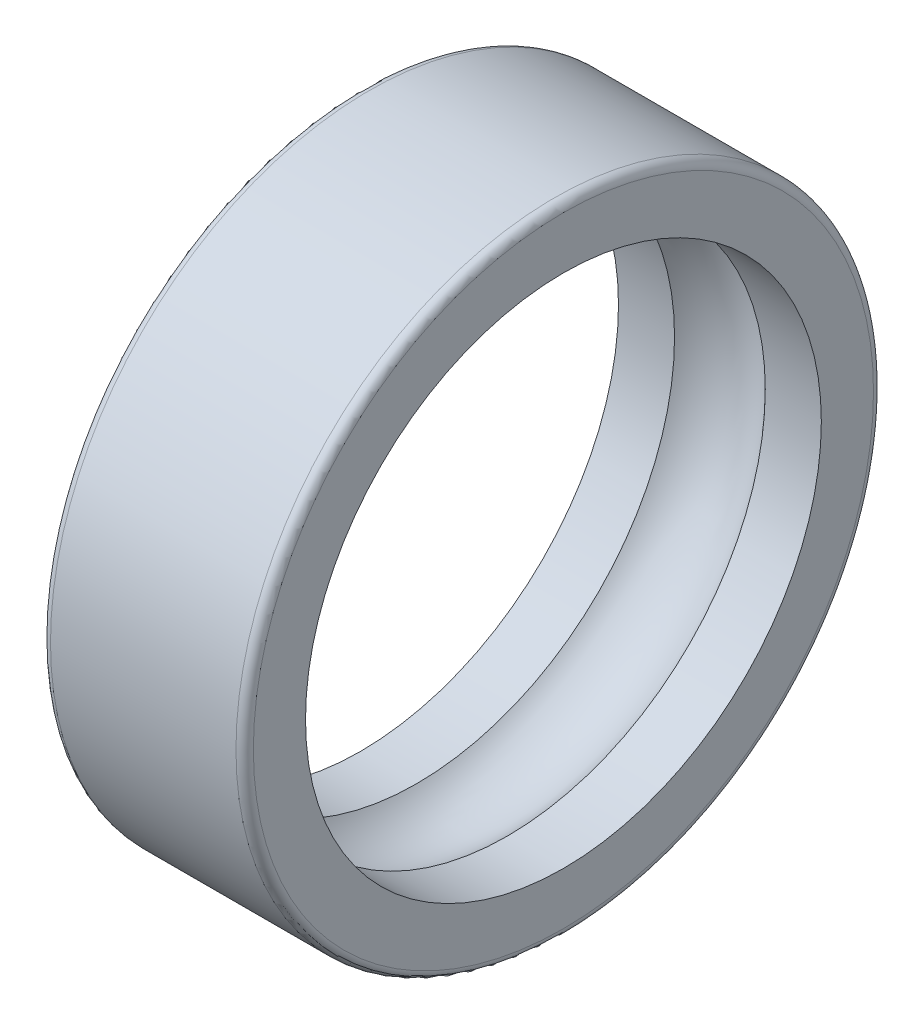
from build123d import *


with BuildPart() as part:
    # Esquisse1 → Base-R_volution (revolve)
    with BuildSketch(Plane(origin=(0, 0, 0), x_dir=(1, 0, 0), z_dir=(0, 1, 0)), mode=Mode.PRIVATE) as base_r_volution_sk:
        with BuildLine():
            Line((0, 10.7), (0, 8.9))
            Line((0, 8.9), (1.934752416, 8.9))
            ThreePointArc((1.934752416, 8.9), (3.5, 9.6), (5.065247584, 8.9))
            Line((5.065247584, 8.9), (7, 8.9))
            Line((7, 8.9), (7, 10.7))
            ThreePointArc((7, 10.7), (6.912132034, 10.912132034), (6.7, 11))
            Line((6.7, 11), (0.3, 11))
            ThreePointArc((0.3, 11), (0.087867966, 10.912132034), (0, 10.7))
        make_face()
    revolve(base_r_volution_sk.sketch.rotate(Axis((0, 0, 0), (1, 0, 0)), 180), axis=Axis((0, 0, 0), (1, 0, 0)))


solid = part.part
